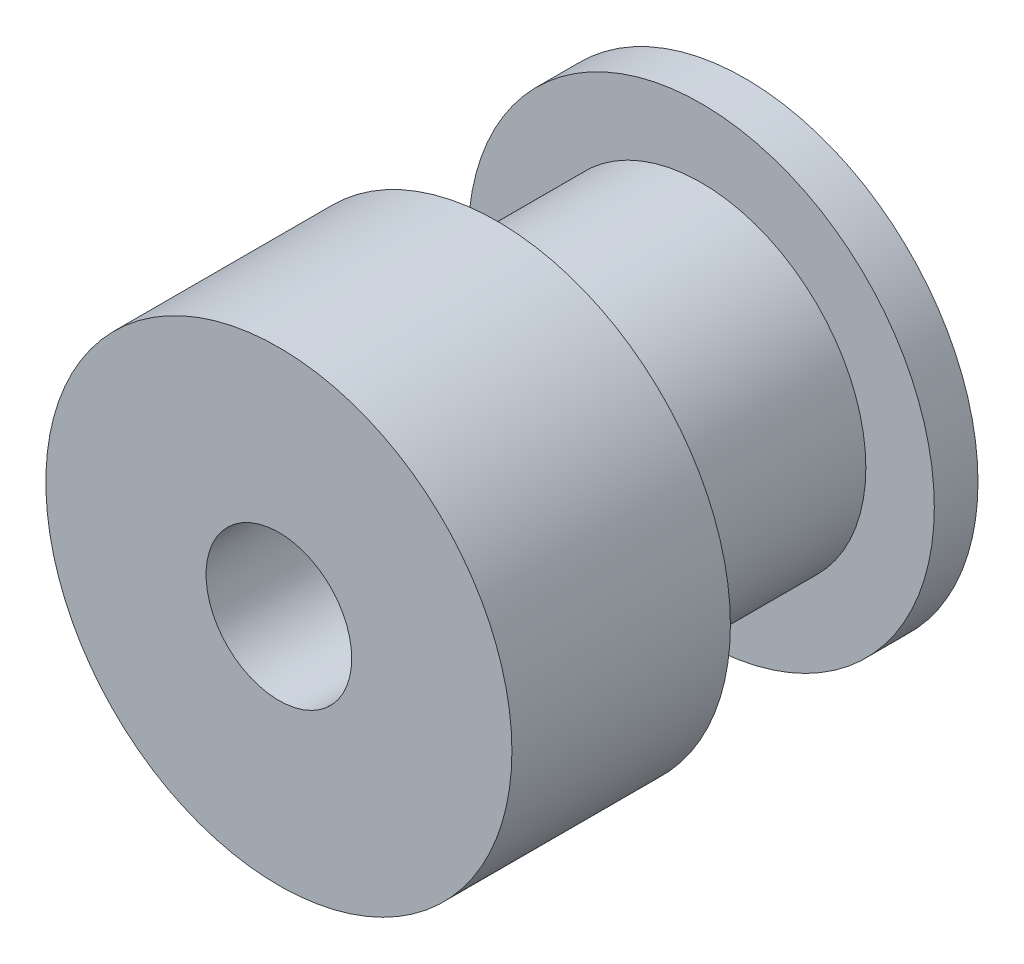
from build123d import *

# Parameters (mm, degrees)
CROQUIS1_R              = 8
CROQUIS1_R_2            = 2.5
SALIENTE_EXTRUIR1_DEPTH = 1.5
CROQUIS2_R              = 5.65
CROQUIS2_R_2            = 2.5
SALIENTE_EXTRUIR2_DEPTH = 7
CROQUIS3_R              = 8
CROQUIS3_R_2            = 2.5
SALIENTE_EXTRUIR3_DEPTH = 7.5


with BuildPart() as part:
    # Croquis1 → Saliente-Extruir1 (new body)
    with BuildSketch(Plane.XY):
        Circle(CROQUIS1_R)
        Circle(CROQUIS1_R_2, mode=Mode.SUBTRACT)
    extrude(amount=SALIENTE_EXTRUIR1_DEPTH)

    # Croquis2 → Saliente-Extruir2 (add)
    with BuildSketch(Plane.XY.offset(1.5)):
        Circle(CROQUIS2_R)
        Circle(CROQUIS2_R_2, mode=Mode.SUBTRACT)
    extrude(amount=SALIENTE_EXTRUIR2_DEPTH)

    # Croquis3 → Saliente-Extruir3 (add)
    with BuildSketch(Plane.XY.offset(8.5)):
        Circle(CROQUIS3_R)
        Circle(CROQUIS3_R_2, mode=Mode.SUBTRACT)
    extrude(amount=SALIENTE_EXTRUIR3_DEPTH)


solid = part.part
